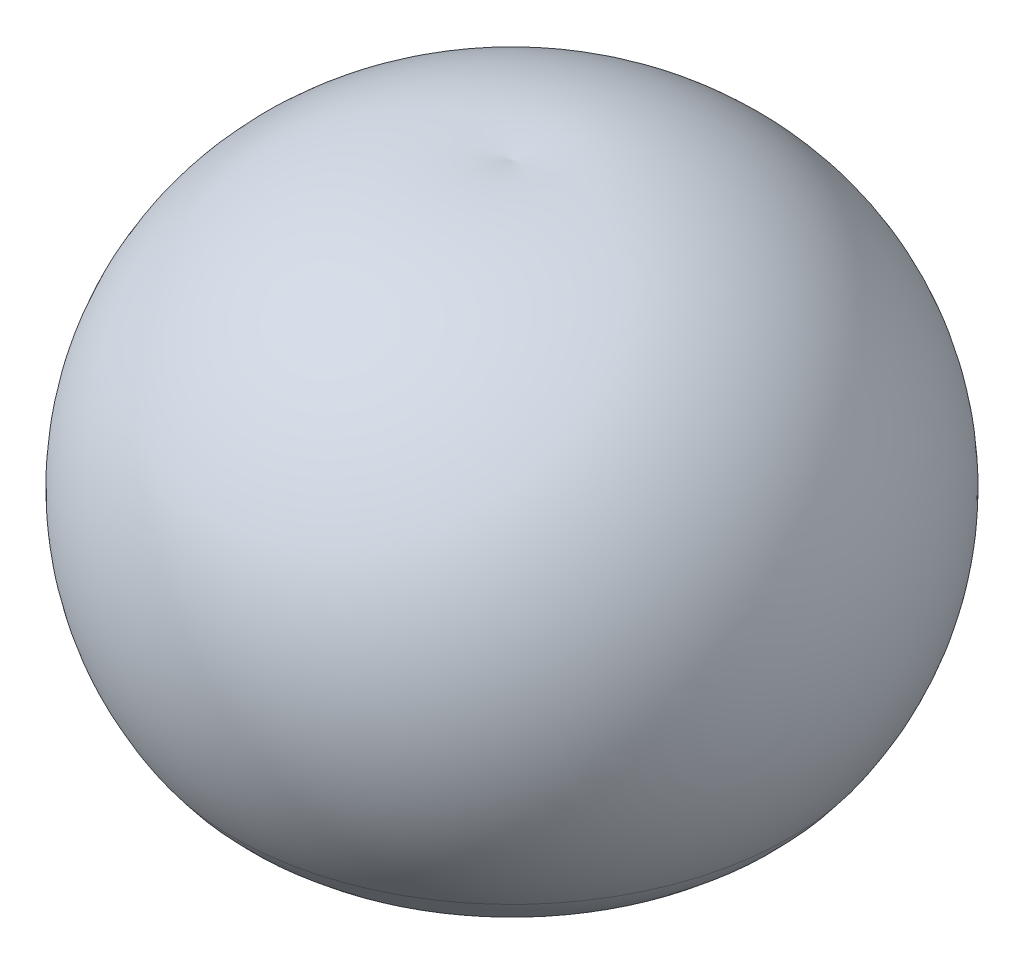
from build123d import *


with BuildPart() as part:
    # Schizzo1 → Rivoluzione1 (revolve)
    with BuildSketch(Plane.XY, mode=Mode.PRIVATE) as rivoluzione1_sk:
        with BuildLine():
            Line((0, 3228.297698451), (0, 2463.379697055))
            ThreePointArc((0, 2463.379697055), (-636.879536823, 1795.423793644), (-745.080988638, 878.868787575))
            ThreePointArc((-745.080988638, 878.868787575), (-862.777002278, 435.662716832), (-552.218815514, 98.264457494))
            ThreePointArc((-552.218815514, 98.264457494), (-392.266505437, -305.497867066), (-4.933050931, -501.919737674))
            ThreePointArc((-4.933050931, -501.919737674), (-1149.253797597, -1598.86415175), (-2618.265938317, -1003.246531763))
            ThreePointArc((-2618.265938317, -1003.246531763), (-2702.827479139, 1974.87338485), (0, 3228.297698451))
        make_face()
    revolve(rivoluzione1_sk.sketch.rotate(Axis((0, 0, 0), (0, 1, 0)), 270), axis=Axis((0, 0, 0), (0, 1, 0)))


solid = part.part
